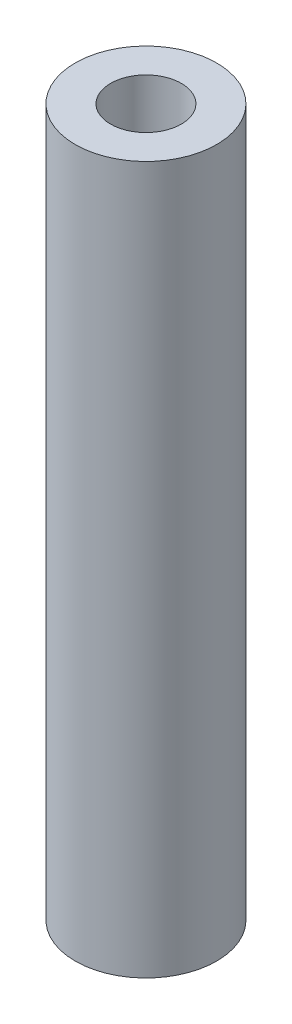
ISO-10303-21;
HEADER;
FILE_DESCRIPTION(('STEP AP214'),'2;1');
FILE_NAME('part.step','',(''),(''),'','','');
FILE_SCHEMA(('AUTOMOTIVE_DESIGN { 1 0 10303 214 1 1 1 1 }'));
ENDSEC;
DATA;
#1=APPLICATION_CONTEXT('core data for automotive mechanical design processes');
#2=APPLICATION_PROTOCOL_DEFINITION('international standard','automotive_design',2000,#1);
#3=PRODUCT_CONTEXT('',#1,'mechanical');
#4=PRODUCT('Part','Part','',(#3));
#5=PRODUCT_RELATED_PRODUCT_CATEGORY('part','',(#4));
#6=PRODUCT_DEFINITION_FORMATION('','',#4);
#7=PRODUCT_DEFINITION_CONTEXT('part definition',#1,'design');
#8=PRODUCT_DEFINITION('design','',#6,#7);
#9=PRODUCT_DEFINITION_SHAPE('','',#8);
#10=(LENGTH_UNIT() NAMED_UNIT(*) SI_UNIT(.MILLI.,.METRE.));
#11=(NAMED_UNIT(*) PLANE_ANGLE_UNIT() SI_UNIT($,.RADIAN.));
#12=(NAMED_UNIT(*) SI_UNIT($,.STERADIAN.) SOLID_ANGLE_UNIT());
#13=UNCERTAINTY_MEASURE_WITH_UNIT(LENGTH_MEASURE(1.E-05),#10,'distance_accuracy_value','');
#14=(GEOMETRIC_REPRESENTATION_CONTEXT(3) GLOBAL_UNCERTAINTY_ASSIGNED_CONTEXT((#13)) GLOBAL_UNIT_ASSIGNED_CONTEXT((#10,
#11,#12)) REPRESENTATION_CONTEXT('',''));
#15=CARTESIAN_POINT('',(0.,0.,0.));
#16=DIRECTION('',(0.,0.,1.));
#17=DIRECTION('',(1.,0.,0.));
#18=AXIS2_PLACEMENT_3D('',#15,#16,#17);
#19=CARTESIAN_POINT('',(0.,25.4,0.));
#20=DIRECTION('',(0.,1.,0.));
#21=DIRECTION('',(0.,0.,1.));
#22=AXIS2_PLACEMENT_3D('',#19,#20,#21);
#23=PLANE('',#22);
#24=CARTESIAN_POINT('',(0.,25.4,0.));
#25=DIRECTION('',(0.,1.,0.));
#26=DIRECTION('',(0.,0.,1.));
#27=AXIS2_PLACEMENT_3D('',#24,#25,#26);
#28=CIRCLE('',#27,2.54);
#29=CARTESIAN_POINT('',(0.,25.4,2.54));
#30=VERTEX_POINT('',#29);
#31=EDGE_CURVE('E10',#30,#30,#28,.T.);
#32=ORIENTED_EDGE('',*,*,#31,.T.);
#33=EDGE_LOOP('',(#32));
#34=FACE_BOUND('',#33,.T.);
#35=CARTESIAN_POINT('',(0.,25.4,0.));
#36=DIRECTION('',(0.,1.,0.));
#37=DIRECTION('',(0.,0.,1.));
#38=AXIS2_PLACEMENT_3D('',#35,#36,#37);
#39=CIRCLE('',#38,1.27);
#40=CARTESIAN_POINT('',(0.,25.4,1.27));
#41=VERTEX_POINT('',#40);
#42=EDGE_CURVE('E42',#41,#41,#39,.T.);
#43=ORIENTED_EDGE('',*,*,#42,.F.);
#44=EDGE_LOOP('',(#43));
#45=FACE_BOUND('',#44,.T.);
#46=ADVANCED_FACE('F31',(#34,#45),#23,.T.);
#47=CARTESIAN_POINT('',(0.,0.,0.));
#48=DIRECTION('',(0.,1.,0.));
#49=DIRECTION('',(0.,0.,1.));
#50=AXIS2_PLACEMENT_3D('',#47,#48,#49);
#51=PLANE('',#50);
#52=CARTESIAN_POINT('',(0.,0.,0.));
#53=DIRECTION('',(0.,1.,0.));
#54=DIRECTION('',(0.,0.,1.));
#55=AXIS2_PLACEMENT_3D('',#52,#53,#54);
#56=CIRCLE('',#55,2.54);
#57=CARTESIAN_POINT('',(0.,0.,2.54));
#58=VERTEX_POINT('',#57);
#59=EDGE_CURVE('E35',#58,#58,#56,.T.);
#60=ORIENTED_EDGE('',*,*,#59,.F.);
#61=EDGE_LOOP('',(#60));
#62=FACE_BOUND('',#61,.T.);
#63=CARTESIAN_POINT('',(0.,0.,0.));
#64=DIRECTION('',(0.,1.,0.));
#65=DIRECTION('',(0.,0.,1.));
#66=AXIS2_PLACEMENT_3D('',#63,#64,#65);
#67=CIRCLE('',#66,1.27);
#68=CARTESIAN_POINT('',(0.,0.,1.27));
#69=VERTEX_POINT('',#68);
#70=EDGE_CURVE('E44',#69,#69,#67,.T.);
#71=ORIENTED_EDGE('',*,*,#70,.T.);
#72=EDGE_LOOP('',(#71));
#73=FACE_BOUND('',#72,.T.);
#74=ADVANCED_FACE('F54',(#62,#73),#51,.F.);
#75=CARTESIAN_POINT('',(0.,25.4,0.));
#76=DIRECTION('',(0.,-1.,0.));
#77=DIRECTION('',(0.,0.,-1.));
#78=AXIS2_PLACEMENT_3D('',#75,#76,#77);
#79=CYLINDRICAL_SURFACE('',#78,2.54);
#80=ORIENTED_EDGE('',*,*,#31,.F.);
#81=EDGE_LOOP('',(#80));
#82=FACE_BOUND('',#81,.T.);
#83=ORIENTED_EDGE('',*,*,#59,.T.);
#84=EDGE_LOOP('',(#83));
#85=FACE_BOUND('',#84,.T.);
#86=ADVANCED_FACE('F33',(#82,#85),#79,.T.);
#87=CARTESIAN_POINT('',(0.,25.4,0.));
#88=DIRECTION('',(0.,-1.,0.));
#89=DIRECTION('',(0.,0.,-1.));
#90=AXIS2_PLACEMENT_3D('',#87,#88,#89);
#91=CYLINDRICAL_SURFACE('',#90,1.27);
#92=ORIENTED_EDGE('',*,*,#42,.T.);
#93=EDGE_LOOP('',(#92));
#94=FACE_BOUND('',#93,.T.);
#95=ORIENTED_EDGE('',*,*,#70,.F.);
#96=EDGE_LOOP('',(#95));
#97=FACE_BOUND('',#96,.T.);
#98=ADVANCED_FACE('F50',(#94,#97),#91,.F.);
#99=CLOSED_SHELL('',(#46,#74,#86,#98));
#100=MANIFOLD_SOLID_BREP('B2',#99);
#101=ADVANCED_BREP_SHAPE_REPRESENTATION('',(#18,#100),#14);
#102=SHAPE_DEFINITION_REPRESENTATION(#9,#101);
ENDSEC;
END-ISO-10303-21;
